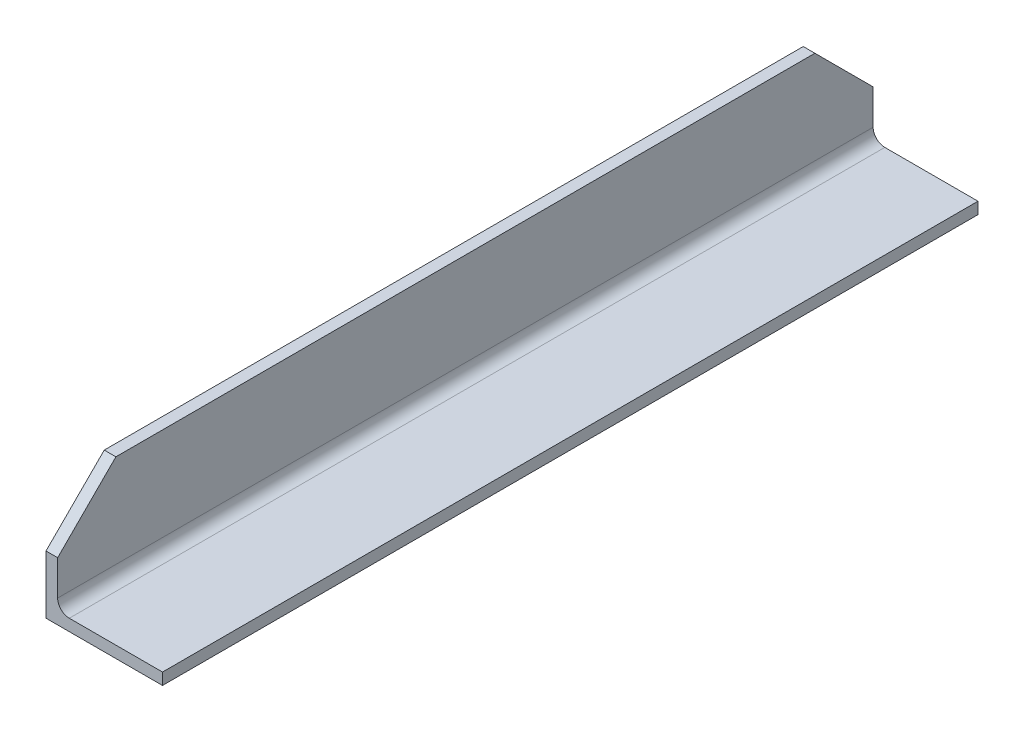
ISO-10303-21;
HEADER;
FILE_DESCRIPTION(('STEP AP214'),'2;1');
FILE_NAME('part.step','',(''),(''),'','','');
FILE_SCHEMA(('AUTOMOTIVE_DESIGN { 1 0 10303 214 1 1 1 1 }'));
ENDSEC;
DATA;
#1=APPLICATION_CONTEXT('core data for automotive mechanical design processes');
#2=APPLICATION_PROTOCOL_DEFINITION('international standard','automotive_design',2000,#1);
#3=PRODUCT_CONTEXT('',#1,'mechanical');
#4=PRODUCT('Part','Part','',(#3));
#5=PRODUCT_RELATED_PRODUCT_CATEGORY('part','',(#4));
#6=PRODUCT_DEFINITION_FORMATION('','',#4);
#7=PRODUCT_DEFINITION_CONTEXT('part definition',#1,'design');
#8=PRODUCT_DEFINITION('design','',#6,#7);
#9=PRODUCT_DEFINITION_SHAPE('','',#8);
#10=(LENGTH_UNIT() NAMED_UNIT(*) SI_UNIT(.MILLI.,.METRE.));
#11=(NAMED_UNIT(*) PLANE_ANGLE_UNIT() SI_UNIT($,.RADIAN.));
#12=(NAMED_UNIT(*) SI_UNIT($,.STERADIAN.) SOLID_ANGLE_UNIT());
#13=UNCERTAINTY_MEASURE_WITH_UNIT(LENGTH_MEASURE(1.E-05),#10,'distance_accuracy_value','');
#14=(GEOMETRIC_REPRESENTATION_CONTEXT(3) GLOBAL_UNCERTAINTY_ASSIGNED_CONTEXT((#13)) GLOBAL_UNIT_ASSIGNED_CONTEXT((#10,
#11,#12)) REPRESENTATION_CONTEXT('',''));
#15=CARTESIAN_POINT('',(0.,0.,0.));
#16=DIRECTION('',(0.,0.,1.));
#17=DIRECTION('',(1.,0.,0.));
#18=AXIS2_PLACEMENT_3D('',#15,#16,#17);
#19=CARTESIAN_POINT('',(10.,100.,700.));
#20=DIRECTION('',(0.,-1.,0.));
#21=DIRECTION('',(0.,0.,-1.));
#22=AXIS2_PLACEMENT_3D('',#19,#20,#21);
#23=PLANE('',#22);
#24=DIRECTION('',(0.,0.,-1.));
#25=VECTOR('',#24,1.);
#26=CARTESIAN_POINT('',(10.,100.,700.));
#27=LINE('',#26,#25);
#28=CARTESIAN_POINT('',(10.,100.,650.));
#29=VERTEX_POINT('',#28);
#30=CARTESIAN_POINT('',(10.,100.,50.0000000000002));
#31=VERTEX_POINT('',#30);
#32=EDGE_CURVE('E140',#29,#31,#27,.T.);
#33=ORIENTED_EDGE('',*,*,#32,.T.);
#34=DIRECTION('',(-1.,0.,0.));
#35=VECTOR('',#34,1.);
#36=CARTESIAN_POINT('',(0.,100.,50.0000000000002));
#37=LINE('',#36,#35);
#38=CARTESIAN_POINT('',(0.,100.,50.0000000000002));
#39=VERTEX_POINT('',#38);
#40=EDGE_CURVE('E166',#31,#39,#37,.T.);
#41=ORIENTED_EDGE('',*,*,#40,.T.);
#42=DIRECTION('',(0.,0.,-1.));
#43=VECTOR('',#42,1.);
#44=CARTESIAN_POINT('',(0.,100.,700.));
#45=LINE('',#44,#43);
#46=CARTESIAN_POINT('',(0.,100.,650.));
#47=VERTEX_POINT('',#46);
#48=EDGE_CURVE('E124',#47,#39,#45,.T.);
#49=ORIENTED_EDGE('',*,*,#48,.F.);
#50=DIRECTION('',(1.,0.,0.));
#51=VECTOR('',#50,1.);
#52=CARTESIAN_POINT('',(10.,100.,650.));
#53=LINE('',#52,#51);
#54=EDGE_CURVE('E164',#47,#29,#53,.T.);
#55=ORIENTED_EDGE('',*,*,#54,.T.);
#56=EDGE_LOOP('',(#33,#41,#49,#55));
#57=FACE_BOUND('',#56,.T.);
#58=ADVANCED_FACE('F33',(#57),#23,.F.);
#59=CARTESIAN_POINT('',(0.,100.,700.));
#60=DIRECTION('',(1.,0.,0.));
#61=DIRECTION('',(0.,1.,0.));
#62=AXIS2_PLACEMENT_3D('',#59,#60,#61);
#63=PLANE('',#62);
#64=ORIENTED_EDGE('',*,*,#48,.T.);
#65=DIRECTION('',(0.,-0.707106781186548,-0.707106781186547));
#66=VECTOR('',#65,1.);
#67=CARTESIAN_POINT('',(0.,100.,50.0000000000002));
#68=LINE('',#67,#66);
#69=CARTESIAN_POINT('',(0.,49.9999999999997,0.));
#70=VERTEX_POINT('',#69);
#71=EDGE_CURVE('E171',#39,#70,#68,.T.);
#72=ORIENTED_EDGE('',*,*,#71,.T.);
#73=DIRECTION('',(0.,-1.,0.));
#74=VECTOR('',#73,1.);
#75=CARTESIAN_POINT('',(0.,100.,0.));
#76=LINE('',#75,#74);
#77=CARTESIAN_POINT('',(0.,0.,0.));
#78=VERTEX_POINT('',#77);
#79=EDGE_CURVE('E121',#70,#78,#76,.T.);
#80=ORIENTED_EDGE('',*,*,#79,.T.);
#81=DIRECTION('',(0.,0.,-1.));
#82=VECTOR('',#81,1.);
#83=CARTESIAN_POINT('',(0.,0.,700.));
#84=LINE('',#83,#82);
#85=CARTESIAN_POINT('',(0.,0.,700.));
#86=VERTEX_POINT('',#85);
#87=EDGE_CURVE('E118',#86,#78,#84,.T.);
#88=ORIENTED_EDGE('',*,*,#87,.F.);
#89=DIRECTION('',(0.,-1.,0.));
#90=VECTOR('',#89,1.);
#91=CARTESIAN_POINT('',(0.,100.,700.));
#92=LINE('',#91,#90);
#93=CARTESIAN_POINT('',(0.,50.,700.));
#94=VERTEX_POINT('',#93);
#95=EDGE_CURVE('E107',#94,#86,#92,.T.);
#96=ORIENTED_EDGE('',*,*,#95,.F.);
#97=DIRECTION('',(0.,-0.707106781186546,0.707106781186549));
#98=VECTOR('',#97,1.);
#99=CARTESIAN_POINT('',(0.,50.,700.));
#100=LINE('',#99,#98);
#101=EDGE_CURVE('E169',#94,#47,#100,.F.);
#102=ORIENTED_EDGE('',*,*,#101,.T.);
#103=EDGE_LOOP('',(#64,#72,#80,#88,#96,#102));
#104=FACE_BOUND('',#103,.T.);
#105=ADVANCED_FACE('F120',(#104),#63,.F.);
#106=CARTESIAN_POINT('',(0.,0.,700.));
#107=DIRECTION('',(0.,1.,0.));
#108=DIRECTION('',(0.,0.,1.));
#109=AXIS2_PLACEMENT_3D('',#106,#107,#108);
#110=PLANE('',#109);
#111=DIRECTION('',(1.,0.,0.));
#112=VECTOR('',#111,1.);
#113=CARTESIAN_POINT('',(0.,0.,0.));
#114=LINE('',#113,#112);
#115=CARTESIAN_POINT('',(100.,0.,0.));
#116=VERTEX_POINT('',#115);
#117=EDGE_CURVE('E142',#78,#116,#114,.T.);
#118=ORIENTED_EDGE('',*,*,#117,.T.);
#119=DIRECTION('',(0.,0.,-1.));
#120=VECTOR('',#119,1.);
#121=CARTESIAN_POINT('',(100.,0.,700.));
#122=LINE('',#121,#120);
#123=CARTESIAN_POINT('',(100.,0.,700.));
#124=VERTEX_POINT('',#123);
#125=EDGE_CURVE('E125',#124,#116,#122,.T.);
#126=ORIENTED_EDGE('',*,*,#125,.F.);
#127=DIRECTION('',(1.,0.,0.));
#128=VECTOR('',#127,1.);
#129=CARTESIAN_POINT('',(0.,0.,700.));
#130=LINE('',#129,#128);
#131=EDGE_CURVE('E111',#86,#124,#130,.T.);
#132=ORIENTED_EDGE('',*,*,#131,.F.);
#133=ORIENTED_EDGE('',*,*,#87,.T.);
#134=EDGE_LOOP('',(#118,#126,#132,#133));
#135=FACE_BOUND('',#134,.T.);
#136=ADVANCED_FACE('F127',(#135),#110,.F.);
#137=CARTESIAN_POINT('',(100.,0.,700.));
#138=DIRECTION('',(-1.,0.,0.));
#139=DIRECTION('',(0.,-1.,0.));
#140=AXIS2_PLACEMENT_3D('',#137,#138,#139);
#141=PLANE('',#140);
#142=DIRECTION('',(0.,1.,0.));
#143=VECTOR('',#142,1.);
#144=CARTESIAN_POINT('',(100.,0.,0.));
#145=LINE('',#144,#143);
#146=CARTESIAN_POINT('',(100.,10.,0.));
#147=VERTEX_POINT('',#146);
#148=EDGE_CURVE('E144',#116,#147,#145,.T.);
#149=ORIENTED_EDGE('',*,*,#148,.T.);
#150=DIRECTION('',(0.,0.,-1.));
#151=VECTOR('',#150,1.);
#152=CARTESIAN_POINT('',(100.,10.,700.));
#153=LINE('',#152,#151);
#154=CARTESIAN_POINT('',(100.,10.,700.));
#155=VERTEX_POINT('',#154);
#156=EDGE_CURVE('E159',#155,#147,#153,.T.);
#157=ORIENTED_EDGE('',*,*,#156,.F.);
#158=DIRECTION('',(0.,1.,0.));
#159=VECTOR('',#158,1.);
#160=CARTESIAN_POINT('',(100.,0.,700.));
#161=LINE('',#160,#159);
#162=EDGE_CURVE('E130',#124,#155,#161,.T.);
#163=ORIENTED_EDGE('',*,*,#162,.F.);
#164=ORIENTED_EDGE('',*,*,#125,.T.);
#165=EDGE_LOOP('',(#149,#157,#163,#164));
#166=FACE_BOUND('',#165,.T.);
#167=ADVANCED_FACE('F186',(#166),#141,.F.);
#168=CARTESIAN_POINT('',(100.,10.,700.));
#169=DIRECTION('',(0.,-1.,0.));
#170=DIRECTION('',(1.,0.,0.));
#171=AXIS2_PLACEMENT_3D('',#168,#169,#170);
#172=PLANE('',#171);
#173=DIRECTION('',(-1.,0.,0.));
#174=VECTOR('',#173,1.);
#175=CARTESIAN_POINT('',(100.,10.,0.));
#176=LINE('',#175,#174);
#177=CARTESIAN_POINT('',(20.,9.99999999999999,0.));
#178=VERTEX_POINT('',#177);
#179=EDGE_CURVE('E146',#147,#178,#176,.T.);
#180=ORIENTED_EDGE('',*,*,#179,.T.);
#181=DIRECTION('',(0.,0.,-1.));
#182=VECTOR('',#181,1.);
#183=CARTESIAN_POINT('',(20.,9.99999999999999,700.));
#184=LINE('',#183,#182);
#185=CARTESIAN_POINT('',(20.,9.99999999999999,700.));
#186=VERTEX_POINT('',#185);
#187=EDGE_CURVE('E156',#186,#178,#184,.T.);
#188=ORIENTED_EDGE('',*,*,#187,.F.);
#189=DIRECTION('',(-1.,0.,0.));
#190=VECTOR('',#189,1.);
#191=CARTESIAN_POINT('',(100.,10.,700.));
#192=LINE('',#191,#190);
#193=EDGE_CURVE('E132',#155,#186,#192,.T.);
#194=ORIENTED_EDGE('',*,*,#193,.F.);
#195=ORIENTED_EDGE('',*,*,#156,.T.);
#196=EDGE_LOOP('',(#180,#188,#194,#195));
#197=FACE_BOUND('',#196,.T.);
#198=ADVANCED_FACE('F193',(#197),#172,.F.);
#199=CARTESIAN_POINT('',(20.,20.,700.));
#200=DIRECTION('',(0.,0.,-1.));
#201=DIRECTION('',(-1.,0.,0.));
#202=AXIS2_PLACEMENT_3D('',#199,#200,#201);
#203=CYLINDRICAL_SURFACE('',#202,10.);
#204=CARTESIAN_POINT('',(20.,20.,0.));
#205=DIRECTION('',(0.,0.,-1.));
#206=DIRECTION('',(-1.,0.,0.));
#207=AXIS2_PLACEMENT_3D('',#204,#205,#206);
#208=CIRCLE('',#207,10.);
#209=CARTESIAN_POINT('',(10.,20.,0.));
#210=VERTEX_POINT('',#209);
#211=EDGE_CURVE('E148',#178,#210,#208,.T.);
#212=ORIENTED_EDGE('',*,*,#211,.T.);
#213=DIRECTION('',(0.,0.,-1.));
#214=VECTOR('',#213,1.);
#215=CARTESIAN_POINT('',(10.,20.,700.));
#216=LINE('',#215,#214);
#217=CARTESIAN_POINT('',(10.,20.,700.));
#218=VERTEX_POINT('',#217);
#219=EDGE_CURVE('E153',#218,#210,#216,.T.);
#220=ORIENTED_EDGE('',*,*,#219,.F.);
#221=CARTESIAN_POINT('',(20.,20.,700.));
#222=DIRECTION('',(0.,0.,-1.));
#223=DIRECTION('',(-1.,0.,0.));
#224=AXIS2_PLACEMENT_3D('',#221,#222,#223);
#225=CIRCLE('',#224,10.);
#226=EDGE_CURVE('E136',#186,#218,#225,.T.);
#227=ORIENTED_EDGE('',*,*,#226,.F.);
#228=ORIENTED_EDGE('',*,*,#187,.T.);
#229=EDGE_LOOP('',(#212,#220,#227,#228));
#230=FACE_BOUND('',#229,.T.);
#231=ADVANCED_FACE('F196',(#230),#203,.F.);
#232=CARTESIAN_POINT('',(10.,20.,700.));
#233=DIRECTION('',(-1.,0.,0.));
#234=DIRECTION('',(0.,0.,1.));
#235=AXIS2_PLACEMENT_3D('',#232,#233,#234);
#236=PLANE('',#235);
#237=DIRECTION('',(0.,1.,0.));
#238=VECTOR('',#237,1.);
#239=CARTESIAN_POINT('',(10.,20.,0.));
#240=LINE('',#239,#238);
#241=CARTESIAN_POINT('',(10.,49.9999999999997,0.));
#242=VERTEX_POINT('',#241);
#243=EDGE_CURVE('E115',#210,#242,#240,.T.);
#244=ORIENTED_EDGE('',*,*,#243,.T.);
#245=DIRECTION('',(0.,0.707106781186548,0.707106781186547));
#246=VECTOR('',#245,1.);
#247=CARTESIAN_POINT('',(10.,100.,50.0000000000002));
#248=LINE('',#247,#246);
#249=EDGE_CURVE('E41',#242,#31,#248,.T.);
#250=ORIENTED_EDGE('',*,*,#249,.T.);
#251=ORIENTED_EDGE('',*,*,#32,.F.);
#252=DIRECTION('',(0.,0.707106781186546,-0.707106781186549));
#253=VECTOR('',#252,1.);
#254=CARTESIAN_POINT('',(10.,50.,700.));
#255=LINE('',#254,#253);
#256=CARTESIAN_POINT('',(10.,50.,700.));
#257=VERTEX_POINT('',#256);
#258=EDGE_CURVE('E48',#29,#257,#255,.F.);
#259=ORIENTED_EDGE('',*,*,#258,.T.);
#260=DIRECTION('',(0.,1.,0.));
#261=VECTOR('',#260,1.);
#262=CARTESIAN_POINT('',(10.,20.,700.));
#263=LINE('',#262,#261);
#264=EDGE_CURVE('E138',#218,#257,#263,.T.);
#265=ORIENTED_EDGE('',*,*,#264,.F.);
#266=ORIENTED_EDGE('',*,*,#219,.T.);
#267=EDGE_LOOP('',(#244,#250,#251,#259,#265,#266));
#268=FACE_BOUND('',#267,.T.);
#269=ADVANCED_FACE('F175',(#268),#236,.F.);
#270=CARTESIAN_POINT('',(20.,20.,700.));
#271=DIRECTION('',(0.,0.,-1.));
#272=DIRECTION('',(-1.,0.,0.));
#273=AXIS2_PLACEMENT_3D('',#270,#271,#272);
#274=PLANE('',#273);
#275=ORIENTED_EDGE('',*,*,#264,.T.);
#276=DIRECTION('',(-1.,0.,0.));
#277=VECTOR('',#276,1.);
#278=CARTESIAN_POINT('',(20.,50.,700.));
#279=LINE('',#278,#277);
#280=EDGE_CURVE('E11',#257,#94,#279,.T.);
#281=ORIENTED_EDGE('',*,*,#280,.T.);
#282=ORIENTED_EDGE('',*,*,#95,.T.);
#283=ORIENTED_EDGE('',*,*,#131,.T.);
#284=ORIENTED_EDGE('',*,*,#162,.T.);
#285=ORIENTED_EDGE('',*,*,#193,.T.);
#286=ORIENTED_EDGE('',*,*,#226,.T.);
#287=EDGE_LOOP('',(#275,#281,#282,#283,#284,#285,#286));
#288=FACE_BOUND('',#287,.T.);
#289=ADVANCED_FACE('F109',(#288),#274,.F.);
#290=CARTESIAN_POINT('',(20.,20.,0.));
#291=DIRECTION('',(0.,0.,-1.));
#292=DIRECTION('',(-1.,0.,0.));
#293=AXIS2_PLACEMENT_3D('',#290,#291,#292);
#294=PLANE('',#293);
#295=ORIENTED_EDGE('',*,*,#79,.F.);
#296=DIRECTION('',(1.,0.,0.));
#297=VECTOR('',#296,1.);
#298=CARTESIAN_POINT('',(10.,49.9999999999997,0.));
#299=LINE('',#298,#297);
#300=EDGE_CURVE('E56',#70,#242,#299,.T.);
#301=ORIENTED_EDGE('',*,*,#300,.T.);
#302=ORIENTED_EDGE('',*,*,#243,.F.);
#303=ORIENTED_EDGE('',*,*,#211,.F.);
#304=ORIENTED_EDGE('',*,*,#179,.F.);
#305=ORIENTED_EDGE('',*,*,#148,.F.);
#306=ORIENTED_EDGE('',*,*,#117,.F.);
#307=EDGE_LOOP('',(#295,#301,#302,#303,#304,#305,#306));
#308=FACE_BOUND('',#307,.T.);
#309=ADVANCED_FACE('F182',(#308),#294,.T.);
#310=CARTESIAN_POINT('',(10.,100.,50.0000000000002));
#311=DIRECTION('',(0.,0.707106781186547,-0.707106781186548));
#312=DIRECTION('',(1.,0.,0.));
#313=AXIS2_PLACEMENT_3D('',#310,#311,#312);
#314=PLANE('',#313);
#315=ORIENTED_EDGE('',*,*,#249,.F.);
#316=ORIENTED_EDGE('',*,*,#300,.F.);
#317=ORIENTED_EDGE('',*,*,#71,.F.);
#318=ORIENTED_EDGE('',*,*,#40,.F.);
#319=EDGE_LOOP('',(#315,#316,#317,#318));
#320=FACE_BOUND('',#319,.T.);
#321=ADVANCED_FACE('F181',(#320),#314,.T.);
#322=CARTESIAN_POINT('',(20.,50.,700.));
#323=DIRECTION('',(0.,-0.707106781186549,-0.707106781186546));
#324=DIRECTION('',(-1.,0.,0.));
#325=AXIS2_PLACEMENT_3D('',#322,#323,#324);
#326=PLANE('',#325);
#327=ORIENTED_EDGE('',*,*,#258,.F.);
#328=ORIENTED_EDGE('',*,*,#54,.F.);
#329=ORIENTED_EDGE('',*,*,#101,.F.);
#330=ORIENTED_EDGE('',*,*,#280,.F.);
#331=EDGE_LOOP('',(#327,#328,#329,#330));
#332=FACE_BOUND('',#331,.T.);
#333=ADVANCED_FACE('F35',(#332),#326,.F.);
#334=CLOSED_SHELL('',(#58,#105,#136,#167,#198,#231,#269,#289,#309,#321,#333));
#335=MANIFOLD_SOLID_BREP('B2',#334);
#336=ADVANCED_BREP_SHAPE_REPRESENTATION('',(#18,#335),#14);
#337=SHAPE_DEFINITION_REPRESENTATION(#9,#336);
ENDSEC;
END-ISO-10303-21;
